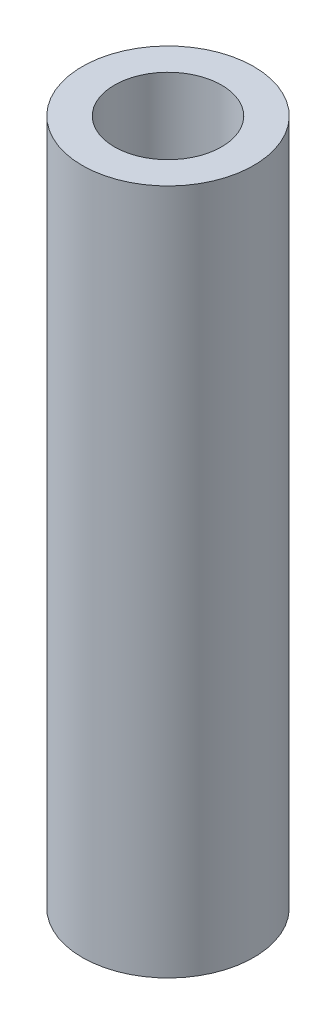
ISO-10303-21;
HEADER;
FILE_DESCRIPTION(('STEP AP214'),'2;1');
FILE_NAME('part.step','',(''),(''),'','','');
FILE_SCHEMA(('AUTOMOTIVE_DESIGN { 1 0 10303 214 1 1 1 1 }'));
ENDSEC;
DATA;
#1=APPLICATION_CONTEXT('core data for automotive mechanical design processes');
#2=APPLICATION_PROTOCOL_DEFINITION('international standard','automotive_design',2000,#1);
#3=PRODUCT_CONTEXT('',#1,'mechanical');
#4=PRODUCT('Part','Part','',(#3));
#5=PRODUCT_RELATED_PRODUCT_CATEGORY('part','',(#4));
#6=PRODUCT_DEFINITION_FORMATION('','',#4);
#7=PRODUCT_DEFINITION_CONTEXT('part definition',#1,'design');
#8=PRODUCT_DEFINITION('design','',#6,#7);
#9=PRODUCT_DEFINITION_SHAPE('','',#8);
#10=(LENGTH_UNIT() NAMED_UNIT(*) SI_UNIT(.MILLI.,.METRE.));
#11=(NAMED_UNIT(*) PLANE_ANGLE_UNIT() SI_UNIT($,.RADIAN.));
#12=(NAMED_UNIT(*) SI_UNIT($,.STERADIAN.) SOLID_ANGLE_UNIT());
#13=UNCERTAINTY_MEASURE_WITH_UNIT(LENGTH_MEASURE(1.E-05),#10,'distance_accuracy_value','');
#14=(GEOMETRIC_REPRESENTATION_CONTEXT(3) GLOBAL_UNCERTAINTY_ASSIGNED_CONTEXT((#13)) GLOBAL_UNIT_ASSIGNED_CONTEXT((#10,
#11,#12)) REPRESENTATION_CONTEXT('',''));
#15=CARTESIAN_POINT('',(0.,0.,0.));
#16=DIRECTION('',(0.,0.,1.));
#17=DIRECTION('',(1.,0.,0.));
#18=AXIS2_PLACEMENT_3D('',#15,#16,#17);
#19=CARTESIAN_POINT('',(0.,32.,0.));
#20=DIRECTION('',(0.,1.,0.));
#21=DIRECTION('',(0.,0.,1.));
#22=AXIS2_PLACEMENT_3D('',#19,#20,#21);
#23=PLANE('',#22);
#24=CARTESIAN_POINT('',(0.,32.,0.));
#25=DIRECTION('',(0.,1.,0.));
#26=DIRECTION('',(0.,0.,1.));
#27=AXIS2_PLACEMENT_3D('',#24,#25,#26);
#28=CIRCLE('',#27,4.);
#29=CARTESIAN_POINT('',(0.,32.,4.));
#30=VERTEX_POINT('',#29);
#31=EDGE_CURVE('E10',#30,#30,#28,.T.);
#32=ORIENTED_EDGE('',*,*,#31,.T.);
#33=EDGE_LOOP('',(#32));
#34=FACE_BOUND('',#33,.T.);
#35=CARTESIAN_POINT('',(0.,32.,0.));
#36=DIRECTION('',(0.,1.,0.));
#37=DIRECTION('',(0.,0.,1.));
#38=AXIS2_PLACEMENT_3D('',#35,#36,#37);
#39=CIRCLE('',#38,2.5);
#40=CARTESIAN_POINT('',(0.,32.,2.5));
#41=VERTEX_POINT('',#40);
#42=EDGE_CURVE('E35',#41,#41,#39,.T.);
#43=ORIENTED_EDGE('',*,*,#42,.F.);
#44=EDGE_LOOP('',(#43));
#45=FACE_BOUND('',#44,.T.);
#46=ADVANCED_FACE('F24',(#34,#45),#23,.T.);
#47=CARTESIAN_POINT('',(0.,0.,0.));
#48=DIRECTION('',(0.,1.,0.));
#49=DIRECTION('',(0.,0.,1.));
#50=AXIS2_PLACEMENT_3D('',#47,#48,#49);
#51=PLANE('',#50);
#52=CARTESIAN_POINT('',(0.,0.,0.));
#53=DIRECTION('',(0.,1.,0.));
#54=DIRECTION('',(0.,0.,1.));
#55=AXIS2_PLACEMENT_3D('',#52,#53,#54);
#56=CIRCLE('',#55,4.);
#57=CARTESIAN_POINT('',(0.,0.,4.));
#58=VERTEX_POINT('',#57);
#59=EDGE_CURVE('E31',#58,#58,#56,.T.);
#60=ORIENTED_EDGE('',*,*,#59,.F.);
#61=EDGE_LOOP('',(#60));
#62=FACE_BOUND('',#61,.T.);
#63=CARTESIAN_POINT('',(0.,0.,0.));
#64=DIRECTION('',(0.,1.,0.));
#65=DIRECTION('',(0.,0.,1.));
#66=AXIS2_PLACEMENT_3D('',#63,#64,#65);
#67=CIRCLE('',#66,2.5);
#68=CARTESIAN_POINT('',(0.,0.,2.5));
#69=VERTEX_POINT('',#68);
#70=EDGE_CURVE('E39',#69,#69,#67,.T.);
#71=ORIENTED_EDGE('',*,*,#70,.T.);
#72=EDGE_LOOP('',(#71));
#73=FACE_BOUND('',#72,.T.);
#74=ADVANCED_FACE('F45',(#62,#73),#51,.F.);
#75=CARTESIAN_POINT('',(0.,32.,0.));
#76=DIRECTION('',(0.,-1.,0.));
#77=DIRECTION('',(0.,0.,-1.));
#78=AXIS2_PLACEMENT_3D('',#75,#76,#77);
#79=CYLINDRICAL_SURFACE('',#78,4.);
#80=ORIENTED_EDGE('',*,*,#31,.F.);
#81=EDGE_LOOP('',(#80));
#82=FACE_BOUND('',#81,.T.);
#83=ORIENTED_EDGE('',*,*,#59,.T.);
#84=EDGE_LOOP('',(#83));
#85=FACE_BOUND('',#84,.T.);
#86=ADVANCED_FACE('F26',(#82,#85),#79,.T.);
#87=CARTESIAN_POINT('',(0.,32.,0.));
#88=DIRECTION('',(0.,-1.,0.));
#89=DIRECTION('',(0.,0.,-1.));
#90=AXIS2_PLACEMENT_3D('',#87,#88,#89);
#91=CYLINDRICAL_SURFACE('',#90,2.5);
#92=ORIENTED_EDGE('',*,*,#42,.T.);
#93=EDGE_LOOP('',(#92));
#94=FACE_BOUND('',#93,.T.);
#95=ORIENTED_EDGE('',*,*,#70,.F.);
#96=EDGE_LOOP('',(#95));
#97=FACE_BOUND('',#96,.T.);
#98=ADVANCED_FACE('F47',(#94,#97),#91,.F.);
#99=CLOSED_SHELL('',(#46,#74,#86,#98));
#100=MANIFOLD_SOLID_BREP('B2',#99);
#101=ADVANCED_BREP_SHAPE_REPRESENTATION('',(#18,#100),#14);
#102=SHAPE_DEFINITION_REPRESENTATION(#9,#101);
ENDSEC;
END-ISO-10303-21;
